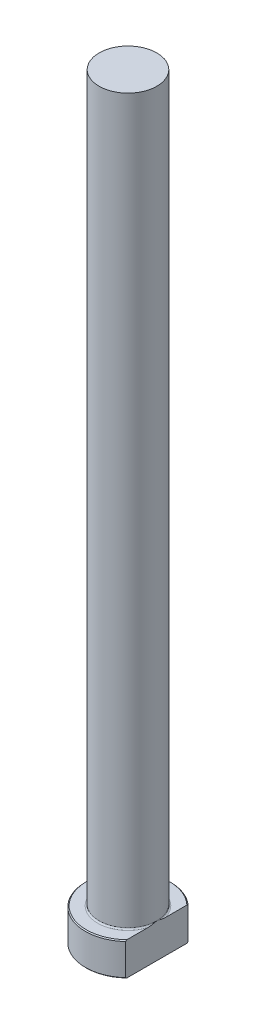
ISO-10303-21;
HEADER;
FILE_DESCRIPTION(('STEP AP214'),'2;1');
FILE_NAME('part.step','',(''),(''),'','','');
FILE_SCHEMA(('AUTOMOTIVE_DESIGN { 1 0 10303 214 1 1 1 1 }'));
ENDSEC;
DATA;
#1=APPLICATION_CONTEXT('core data for automotive mechanical design processes');
#2=APPLICATION_PROTOCOL_DEFINITION('international standard','automotive_design',2000,#1);
#3=PRODUCT_CONTEXT('',#1,'mechanical');
#4=PRODUCT('Part','Part','',(#3));
#5=PRODUCT_RELATED_PRODUCT_CATEGORY('part','',(#4));
#6=PRODUCT_DEFINITION_FORMATION('','',#4);
#7=PRODUCT_DEFINITION_CONTEXT('part definition',#1,'design');
#8=PRODUCT_DEFINITION('design','',#6,#7);
#9=PRODUCT_DEFINITION_SHAPE('','',#8);
#10=(LENGTH_UNIT() NAMED_UNIT(*) SI_UNIT(.MILLI.,.METRE.));
#11=(NAMED_UNIT(*) PLANE_ANGLE_UNIT() SI_UNIT($,.RADIAN.));
#12=(NAMED_UNIT(*) SI_UNIT($,.STERADIAN.) SOLID_ANGLE_UNIT());
#13=UNCERTAINTY_MEASURE_WITH_UNIT(LENGTH_MEASURE(1.E-05),#10,'distance_accuracy_value','');
#14=(GEOMETRIC_REPRESENTATION_CONTEXT(3) GLOBAL_UNCERTAINTY_ASSIGNED_CONTEXT((#13)) GLOBAL_UNIT_ASSIGNED_CONTEXT((#10,
#11,#12)) REPRESENTATION_CONTEXT('',''));
#15=CARTESIAN_POINT('',(0.,0.,0.));
#16=DIRECTION('',(0.,0.,1.));
#17=DIRECTION('',(1.,0.,0.));
#18=AXIS2_PLACEMENT_3D('',#15,#16,#17);
#19=CARTESIAN_POINT('',(0.,0.,0.));
#20=DIRECTION('',(0.,-1.,0.));
#21=DIRECTION('',(0.,0.,-1.));
#22=AXIS2_PLACEMENT_3D('',#19,#20,#21);
#23=PLANE('',#22);
#24=CARTESIAN_POINT('',(0.,0.,0.));
#25=DIRECTION('',(0.,-1.,0.));
#26=DIRECTION('',(0.,0.,-1.));
#27=AXIS2_PLACEMENT_3D('',#24,#25,#26);
#28=CIRCLE('',#27,8.79999999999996);
#29=CARTESIAN_POINT('',(6.09999999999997,0.,6.34271235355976));
#30=VERTEX_POINT('',#29);
#31=CARTESIAN_POINT('',(6.09999999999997,0.,-6.34271235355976));
#32=VERTEX_POINT('',#31);
#33=EDGE_CURVE('E98',#30,#32,#28,.T.);
#34=ORIENTED_EDGE('',*,*,#33,.T.);
#35=DIRECTION('',(0.,0.,1.));
#36=VECTOR('',#35,1.);
#37=CARTESIAN_POINT('',(6.09999999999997,0.,-6.61740130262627));
#38=LINE('',#37,#36);
#39=EDGE_CURVE('E83',#32,#30,#38,.T.);
#40=ORIENTED_EDGE('',*,*,#39,.T.);
#41=EDGE_LOOP('',(#34,#40));
#42=FACE_BOUND('',#41,.T.);
#43=ADVANCED_FACE('F32',(#42),#23,.T.);
#44=CARTESIAN_POINT('',(0.,259.958771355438,0.));
#45=DIRECTION('',(0.,1.,0.));
#46=DIRECTION('',(0.,0.,1.));
#47=AXIS2_PLACEMENT_3D('',#44,#45,#46);
#48=CYLINDRICAL_SURFACE('',#47,8.99999999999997);
#49=CARTESIAN_POINT('',(0.,6.80000000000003,0.));
#50=DIRECTION('',(0.,1.,0.));
#51=DIRECTION('',(0.,0.,1.));
#52=AXIS2_PLACEMENT_3D('',#49,#50,#51);
#53=CIRCLE('',#52,8.99999999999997);
#54=CARTESIAN_POINT('',(6.09999999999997,6.80000000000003,6.61740130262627));
#55=VERTEX_POINT('',#54);
#56=CARTESIAN_POINT('',(6.09999999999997,6.80000000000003,-6.61740130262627));
#57=VERTEX_POINT('',#56);
#58=EDGE_CURVE('E104',#55,#57,#53,.F.);
#59=ORIENTED_EDGE('',*,*,#58,.T.);
#60=DIRECTION('',(0.,-1.,0.));
#61=VECTOR('',#60,1.);
#62=CARTESIAN_POINT('',(6.09999999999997,160.,-6.61740130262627));
#63=LINE('',#62,#61);
#64=CARTESIAN_POINT('',(6.09999999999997,0.199999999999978,-6.61740130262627));
#65=VERTEX_POINT('',#64);
#66=EDGE_CURVE('E183',#57,#65,#63,.T.);
#67=ORIENTED_EDGE('',*,*,#66,.T.);
#68=CARTESIAN_POINT('',(0.,0.199999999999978,0.));
#69=DIRECTION('',(0.,-1.,0.));
#70=DIRECTION('',(0.,0.,-1.));
#71=AXIS2_PLACEMENT_3D('',#68,#69,#70);
#72=CIRCLE('',#71,8.99999999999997);
#73=CARTESIAN_POINT('',(6.09999999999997,0.199999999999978,6.61740130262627));
#74=VERTEX_POINT('',#73);
#75=EDGE_CURVE('E100',#65,#74,#72,.F.);
#76=ORIENTED_EDGE('',*,*,#75,.T.);
#77=DIRECTION('',(0.,-1.,0.));
#78=VECTOR('',#77,1.);
#79=CARTESIAN_POINT('',(6.09999999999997,160.,6.61740130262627));
#80=LINE('',#79,#78);
#81=EDGE_CURVE('E93',#55,#74,#80,.T.);
#82=ORIENTED_EDGE('',*,*,#81,.F.);
#83=EDGE_LOOP('',(#59,#67,#76,#82));
#84=FACE_BOUND('',#83,.T.);
#85=ADVANCED_FACE('F158',(#84),#48,.T.);
#86=CARTESIAN_POINT('',(-8.99999999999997,7.,0.));
#87=DIRECTION('',(0.,1.,0.));
#88=DIRECTION('',(0.,0.,1.));
#89=AXIS2_PLACEMENT_3D('',#86,#87,#88);
#90=PLANE('',#89);
#91=CARTESIAN_POINT('',(0.,7.,0.));
#92=DIRECTION('',(0.,1.,0.));
#93=DIRECTION('',(0.,0.,1.));
#94=AXIS2_PLACEMENT_3D('',#91,#92,#93);
#95=CIRCLE('',#94,8.79999999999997);
#96=CARTESIAN_POINT('',(6.09999999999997,7.,-6.34271235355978));
#97=VERTEX_POINT('',#96);
#98=CARTESIAN_POINT('',(6.09999999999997,7.,6.34271235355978));
#99=VERTEX_POINT('',#98);
#100=EDGE_CURVE('E178',#97,#99,#95,.T.);
#101=ORIENTED_EDGE('',*,*,#100,.T.);
#102=DIRECTION('',(0.,0.,-1.));
#103=VECTOR('',#102,1.);
#104=CARTESIAN_POINT('',(6.09999999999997,7.,0.));
#105=LINE('',#104,#103);
#106=CARTESIAN_POINT('',(6.09999999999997,6.99999999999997,1.9364916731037));
#107=VERTEX_POINT('',#106);
#108=EDGE_CURVE('E57',#99,#107,#105,.T.);
#109=ORIENTED_EDGE('',*,*,#108,.T.);
#110=CARTESIAN_POINT('',(0.,7.,0.));
#111=DIRECTION('',(0.,1.,0.));
#112=DIRECTION('',(0.,0.,1.));
#113=AXIS2_PLACEMENT_3D('',#110,#111,#112);
#114=CIRCLE('',#113,6.39999999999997);
#115=CARTESIAN_POINT('',(6.09999999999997,6.99999999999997,-1.9364916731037));
#116=VERTEX_POINT('',#115);
#117=EDGE_CURVE('E107',#107,#116,#114,.F.);
#118=ORIENTED_EDGE('',*,*,#117,.T.);
#119=EDGE_CURVE('E136',#116,#97,#105,.T.);
#120=ORIENTED_EDGE('',*,*,#119,.T.);
#121=EDGE_LOOP('',(#101,#109,#118,#120));
#122=FACE_BOUND('',#121,.T.);
#123=ADVANCED_FACE('F147',(#122),#90,.T.);
#124=CARTESIAN_POINT('',(0.,7.00000000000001,0.));
#125=DIRECTION('',(0.,-1.,0.));
#126=DIRECTION('',(0.,0.,-1.));
#127=AXIS2_PLACEMENT_3D('',#124,#125,#126);
#128=CONICAL_SURFACE('',#127,8.79999999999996,0.785398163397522);
#129=ORIENTED_EDGE('',*,*,#58,.F.);
#130=CARTESIAN_POINT('',(6.09999999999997,0.0143792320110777,14.5593895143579));
#131=CARTESIAN_POINT('',(6.09999999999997,0.214324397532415,14.3426005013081));
#132=CARTESIAN_POINT('',(6.09999999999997,0.413913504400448,14.1254831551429));
#133=CARTESIAN_POINT('',(6.09999999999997,0.812271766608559,13.6904946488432));
#134=CARTESIAN_POINT('',(6.09999999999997,1.01104091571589,13.4726234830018));
#135=CARTESIAN_POINT('',(6.09999999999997,1.6060389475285,12.8176429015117));
#136=CARTESIAN_POINT('',(6.09999999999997,2.00087078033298,12.3792612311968));
#137=CARTESIAN_POINT('',(6.09999999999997,2.78792222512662,11.4954287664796));
#138=CARTESIAN_POINT('',(6.09999999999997,3.18011200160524,11.0499513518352));
#139=CARTESIAN_POINT('',(6.09999999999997,3.95753447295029,10.1530375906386));
#140=CARTESIAN_POINT('',(6.09999999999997,4.34276798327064,9.70160195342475));
#141=CARTESIAN_POINT('',(6.09999999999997,5.03085646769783,8.87725822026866));
#142=CARTESIAN_POINT('',(6.09999999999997,5.33541849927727,8.50578180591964));
#143=CARTESIAN_POINT('',(6.09999999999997,5.78551221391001,7.94308202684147));
#144=CARTESIAN_POINT('',(6.09999999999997,5.93443884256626,7.75457459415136));
#145=CARTESIAN_POINT('',(6.09999999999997,6.22957503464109,7.37544710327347));
#146=CARTESIAN_POINT('',(6.09999999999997,6.3757846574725,7.18482709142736));
#147=CARTESIAN_POINT('',(6.09999999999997,6.66478900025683,6.80131984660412));
#148=CARTESIAN_POINT('',(6.09999999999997,6.80758709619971,6.60843516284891));
#149=CARTESIAN_POINT('',(6.09999999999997,7.08920912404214,6.21979246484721));
#150=CARTESIAN_POINT('',(6.09999999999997,7.22803324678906,6.02403458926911));
#151=CARTESIAN_POINT('',(6.09999999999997,7.50074563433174,5.62920968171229));
#152=CARTESIAN_POINT('',(6.09999999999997,7.63463576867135,5.43014394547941));
#153=CARTESIAN_POINT('',(6.09999999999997,7.89632379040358,5.02806147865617));
#154=CARTESIAN_POINT('',(6.09999999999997,8.02412236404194,4.82504519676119));
#155=CARTESIAN_POINT('',(6.09999999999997,8.27075787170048,4.41652900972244));
#156=CARTESIAN_POINT('',(6.09999999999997,8.38967506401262,4.21107783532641));
#157=CARTESIAN_POINT('',(6.09999999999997,8.61801299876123,3.7948929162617));
#158=CARTESIAN_POINT('',(6.09999999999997,8.72743269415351,3.58415859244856));
#159=CARTESIAN_POINT('',(6.09999999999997,8.93404173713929,3.15694629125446));
#160=CARTESIAN_POINT('',(6.09999999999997,9.0312415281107,2.94047341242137));
#161=CARTESIAN_POINT('',(6.09999999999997,9.21017577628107,2.50119284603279));
#162=CARTESIAN_POINT('',(6.09999999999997,9.29191471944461,2.27838701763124));
#163=CARTESIAN_POINT('',(6.09999999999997,9.42038701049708,1.87551854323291));
#164=CARTESIAN_POINT('',(6.09999999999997,9.47086768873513,1.69665770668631));
#165=CARTESIAN_POINT('',(6.09999999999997,9.55795989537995,1.33556522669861));
#166=CARTESIAN_POINT('',(6.09999999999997,9.59457323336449,1.15333402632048));
#167=CARTESIAN_POINT('',(6.09999999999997,9.65210004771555,0.786944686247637));
#168=CARTESIAN_POINT('',(6.09999999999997,9.67306111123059,0.602794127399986));
#169=CARTESIAN_POINT('',(6.09999999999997,9.69831980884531,0.23334258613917));
#170=CARTESIAN_POINT('',(6.09999999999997,9.70261818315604,0.0480416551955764));
#171=CARTESIAN_POINT('',(6.09999999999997,9.69429534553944,-0.322485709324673));
#172=CARTESIAN_POINT('',(6.09999999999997,9.68164564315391,-0.507711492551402));
#173=CARTESIAN_POINT('',(6.09999999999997,9.64009976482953,-0.876317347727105));
#174=CARTESIAN_POINT('',(6.09999999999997,9.61120224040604,-1.0596972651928));
#175=CARTESIAN_POINT('',(6.09999999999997,9.53854055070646,-1.42403078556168));
#176=CARTESIAN_POINT('',(6.09999999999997,9.49473105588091,-1.60497522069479));
#177=CARTESIAN_POINT('',(6.09999999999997,9.39417906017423,-1.96319042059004));
#178=CARTESIAN_POINT('',(6.09999999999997,9.33743624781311,-2.14046109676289));
#179=CARTESIAN_POINT('',(6.09999999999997,9.20325707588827,-2.51852539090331));
#180=CARTESIAN_POINT('',(6.09999999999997,9.12397188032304,-2.71865799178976));
#181=CARTESIAN_POINT('',(6.09999999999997,8.95352574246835,-3.11384323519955));
#182=CARTESIAN_POINT('',(6.09999999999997,8.86235948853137,-3.30889355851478));
#183=CARTESIAN_POINT('',(6.09999999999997,8.67035859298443,-3.69456420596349));
#184=CARTESIAN_POINT('',(6.09999999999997,8.56950736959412,-3.88517621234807));
#185=CARTESIAN_POINT('',(6.09999999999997,8.36017703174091,-4.26210307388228));
#186=CARTESIAN_POINT('',(6.09999999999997,8.25169895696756,-4.44841851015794));
#187=CARTESIAN_POINT('',(6.09999999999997,8.02723055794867,-4.81954803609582));
#188=CARTESIAN_POINT('',(6.09999999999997,7.91116499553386,-5.00431640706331));
#189=CARTESIAN_POINT('',(6.09999999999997,7.67391977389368,-5.37053346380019));
#190=CARTESIAN_POINT('',(6.09999999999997,7.55273998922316,-5.55198206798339));
#191=CARTESIAN_POINT('',(6.09999999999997,7.30632827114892,-5.91182164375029));
#192=CARTESIAN_POINT('',(6.09999999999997,7.18110067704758,-6.09021559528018));
#193=CARTESIAN_POINT('',(6.09999999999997,6.92719024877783,-6.44453156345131));
#194=CARTESIAN_POINT('',(6.09999999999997,6.79850727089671,-6.62045347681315));
#195=CARTESIAN_POINT('',(6.09999999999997,6.40743139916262,-7.14601004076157));
#196=CARTESIAN_POINT('',(6.09999999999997,6.14071269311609,-7.49242581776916));
#197=CARTESIAN_POINT('',(6.09999999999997,5.59909026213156,-8.17880344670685));
#198=CARTESIAN_POINT('',(6.09999999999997,5.32418574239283,-8.51876466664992));
#199=CARTESIAN_POINT('',(6.09999999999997,4.76812622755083,-9.19396082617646));
#200=CARTESIAN_POINT('',(6.09999999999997,4.48696661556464,-9.52919195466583));
#201=CARTESIAN_POINT('',(6.09999999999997,3.92006700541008,-10.1957589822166));
#202=CARTESIAN_POINT('',(6.09999999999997,3.63432692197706,-10.5270948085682));
#203=CARTESIAN_POINT('',(6.09999999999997,3.07379660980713,-11.1700382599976));
#204=CARTESIAN_POINT('',(6.09999999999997,2.79918078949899,-11.4817981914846));
#205=CARTESIAN_POINT('',(6.09999999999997,2.24738477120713,-12.1030461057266));
#206=CARTESIAN_POINT('',(6.09999999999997,1.97020453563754,-12.4125340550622));
#207=CARTESIAN_POINT('',(6.09999999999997,1.41421579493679,-13.0291430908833));
#208=CARTESIAN_POINT('',(6.09999999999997,1.13541061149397,-13.3362671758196));
#209=CARTESIAN_POINT('',(6.09999999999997,0.576091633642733,-13.9489357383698));
#210=CARTESIAN_POINT('',(6.09999999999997,0.295577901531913,-14.2544802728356));
#211=CARTESIAN_POINT('',(6.09999999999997,0.0143792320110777,-14.5593895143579));
#212=B_SPLINE_CURVE_WITH_KNOTS('',3,(#130,#131,#132,#133,#134,#135,#136,#137,#138,#139,#140,
#141,#142,#143,#144,#145,#146,#147,#148,#149,#150,#151,#152,#153,#154,#155,#156,#157,#158,#159,
#160,#161,#162,#163,#164,#165,#166,#167,#168,#169,#170,#171,#172,#173,#174,#175,#176,#177,#178,
#179,#180,#181,#182,#183,#184,#185,#186,#187,#188,#189,#190,#191,#192,#193,#194,#195,#196,#197,
#198,#199,#200,#201,#202,#203,#204,#205,#206,#207,#208,#209,#210,#211),.UNSPECIFIED.,.F.,.F.,(4,
2,2,2,2,2,2,2,2,2,2,2,2,2,2,2,2,2,2,2,2,2,2,2,2,2,2,2,2,2,2,2,2,2,2,2,2,2,2,2,4),(0.,
0.88474771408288,1.76950214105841,3.53939834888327,5.31990146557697,7.10019448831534,
8.54118050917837,9.26187437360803,9.98255246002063,10.7024850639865,11.4223830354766,
12.1420053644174,12.8615464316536,13.5735035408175,14.2855390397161,14.9969618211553,
15.7081778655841,16.2652530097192,16.822255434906,17.3775574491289,17.9328347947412,
18.4890467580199,19.0453048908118,19.6032692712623,20.1612470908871,20.8065589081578,
21.4521602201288,22.0988872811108,22.7455263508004,23.4000191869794,24.0545280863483,
24.7083572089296,25.3622135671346,26.6736120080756,27.9851381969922,29.2976668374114,
30.6102199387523,31.8565868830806,33.102972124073,34.3473597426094,35.5917022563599),.UNSPECIFIED.);
#213=EDGE_CURVE('E135',#55,#99,#212,.T.);
#214=ORIENTED_EDGE('',*,*,#213,.T.);
#215=ORIENTED_EDGE('',*,*,#100,.F.);
#216=EDGE_CURVE('E127',#97,#57,#212,.T.);
#217=ORIENTED_EDGE('',*,*,#216,.T.);
#218=EDGE_LOOP('',(#129,#214,#215,#217));
#219=FACE_BOUND('',#218,.T.);
#220=ADVANCED_FACE('F143',(#219),#128,.T.);
#221=CARTESIAN_POINT('',(0.,0.199999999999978,0.));
#222=DIRECTION('',(0.,1.,0.));
#223=DIRECTION('',(0.,0.,1.));
#224=AXIS2_PLACEMENT_3D('',#221,#222,#223);
#225=CONICAL_SURFACE('',#224,8.99999999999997,0.785398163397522);
#226=ORIENTED_EDGE('',*,*,#75,.F.);
#227=CARTESIAN_POINT('',(6.09999999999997,6.98562076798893,-14.5593895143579));
#228=CARTESIAN_POINT('',(6.09999999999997,6.78567560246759,-14.3426005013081));
#229=CARTESIAN_POINT('',(6.09999999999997,6.58608649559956,-14.1254831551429));
#230=CARTESIAN_POINT('',(6.09999999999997,6.18772823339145,-13.6904946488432));
#231=CARTESIAN_POINT('',(6.09999999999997,5.98895908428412,-13.4726234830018));
#232=CARTESIAN_POINT('',(6.09999999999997,5.39396105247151,-12.8176429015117));
#233=CARTESIAN_POINT('',(6.09999999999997,4.99912921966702,-12.3792612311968));
#234=CARTESIAN_POINT('',(6.09999999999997,4.21207777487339,-11.4954287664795));
#235=CARTESIAN_POINT('',(6.09999999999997,3.81988799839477,-11.0499513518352));
#236=CARTESIAN_POINT('',(6.09999999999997,3.04246552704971,-10.1530375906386));
#237=CARTESIAN_POINT('',(6.09999999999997,2.65723201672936,-9.70160195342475));
#238=CARTESIAN_POINT('',(6.09999999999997,1.96914353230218,-8.87725822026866));
#239=CARTESIAN_POINT('',(6.09999999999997,1.66458150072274,-8.50578180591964));
#240=CARTESIAN_POINT('',(6.09999999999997,1.21448778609,-7.94308202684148));
#241=CARTESIAN_POINT('',(6.09999999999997,1.06556115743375,-7.75457459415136));
#242=CARTESIAN_POINT('',(6.09999999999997,0.770424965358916,-7.37544710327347));
#243=CARTESIAN_POINT('',(6.09999999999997,0.624215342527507,-7.18482709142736));
#244=CARTESIAN_POINT('',(6.09999999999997,0.335210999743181,-6.80131984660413));
#245=CARTESIAN_POINT('',(6.09999999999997,0.192412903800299,-6.60843516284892));
#246=CARTESIAN_POINT('',(6.09999999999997,-0.0892091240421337,-6.21979246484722));
#247=CARTESIAN_POINT('',(6.09999999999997,-0.228033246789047,-6.02403458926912));
#248=CARTESIAN_POINT('',(6.09999999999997,-0.500745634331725,-5.6292096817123));
#249=CARTESIAN_POINT('',(6.09999999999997,-0.634635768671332,-5.43014394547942));
#250=CARTESIAN_POINT('',(6.09999999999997,-0.896323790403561,-5.02806147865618));
#251=CARTESIAN_POINT('',(6.09999999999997,-1.02412236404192,-4.8250451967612));
#252=CARTESIAN_POINT('',(6.09999999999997,-1.27075787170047,-4.41652900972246));
#253=CARTESIAN_POINT('',(6.09999999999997,-1.3896750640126,-4.21107783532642));
#254=CARTESIAN_POINT('',(6.09999999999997,-1.61801299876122,-3.79489291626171));
#255=CARTESIAN_POINT('',(6.09999999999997,-1.7274326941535,-3.58415859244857));
#256=CARTESIAN_POINT('',(6.09999999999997,-1.93404173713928,-3.15694629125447));
#257=CARTESIAN_POINT('',(6.09999999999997,-2.03124152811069,-2.94047341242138));
#258=CARTESIAN_POINT('',(6.09999999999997,-2.21017577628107,-2.50119284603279));
#259=CARTESIAN_POINT('',(6.09999999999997,-2.2919147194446,-2.27838701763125));
#260=CARTESIAN_POINT('',(6.09999999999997,-2.42038701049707,-1.87551854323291));
#261=CARTESIAN_POINT('',(6.09999999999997,-2.47086768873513,-1.69665770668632));
#262=CARTESIAN_POINT('',(6.09999999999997,-2.55795989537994,-1.33556522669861));
#263=CARTESIAN_POINT('',(6.09999999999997,-2.59457323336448,-1.15333402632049));
#264=CARTESIAN_POINT('',(6.09999999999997,-2.65210004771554,-0.786944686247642));
#265=CARTESIAN_POINT('',(6.09999999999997,-2.67306111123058,-0.60279412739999));
#266=CARTESIAN_POINT('',(6.09999999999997,-2.69831980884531,-0.233342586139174));
#267=CARTESIAN_POINT('',(6.09999999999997,-2.70261818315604,-0.0480416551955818));
#268=CARTESIAN_POINT('',(6.09999999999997,-2.69429534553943,0.322485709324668));
#269=CARTESIAN_POINT('',(6.09999999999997,-2.6816456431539,0.507711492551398));
#270=CARTESIAN_POINT('',(6.09999999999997,-2.64009976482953,0.876317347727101));
#271=CARTESIAN_POINT('',(6.09999999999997,-2.61120224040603,1.05969726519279));
#272=CARTESIAN_POINT('',(6.09999999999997,-2.53854055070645,1.42403078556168));
#273=CARTESIAN_POINT('',(6.09999999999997,-2.4947310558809,1.60497522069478));
#274=CARTESIAN_POINT('',(6.09999999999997,-2.39417906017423,1.96319042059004));
#275=CARTESIAN_POINT('',(6.09999999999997,-2.33743624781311,2.14046109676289));
#276=CARTESIAN_POINT('',(6.09999999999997,-2.20325707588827,2.51852539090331));
#277=CARTESIAN_POINT('',(6.09999999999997,-2.12397188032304,2.71865799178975));
#278=CARTESIAN_POINT('',(6.09999999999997,-1.95352574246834,3.11384323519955));
#279=CARTESIAN_POINT('',(6.09999999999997,-1.86235948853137,3.30889355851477));
#280=CARTESIAN_POINT('',(6.09999999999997,-1.67035859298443,3.69456420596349));
#281=CARTESIAN_POINT('',(6.09999999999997,-1.56950736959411,3.88517621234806));
#282=CARTESIAN_POINT('',(6.09999999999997,-1.36017703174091,4.26210307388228));
#283=CARTESIAN_POINT('',(6.09999999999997,-1.25169895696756,4.44841851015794));
#284=CARTESIAN_POINT('',(6.09999999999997,-1.02723055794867,4.81954803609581));
#285=CARTESIAN_POINT('',(6.09999999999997,-0.911164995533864,5.0043164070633));
#286=CARTESIAN_POINT('',(6.09999999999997,-0.673919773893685,5.37053346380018));
#287=CARTESIAN_POINT('',(6.09999999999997,-0.552739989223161,5.55198206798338));
#288=CARTESIAN_POINT('',(6.09999999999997,-0.306328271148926,5.91182164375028));
#289=CARTESIAN_POINT('',(6.09999999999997,-0.181100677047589,6.09021559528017));
#290=CARTESIAN_POINT('',(6.09999999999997,0.0728097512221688,6.44453156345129));
#291=CARTESIAN_POINT('',(6.09999999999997,0.201492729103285,6.62045347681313));
#292=CARTESIAN_POINT('',(6.09999999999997,0.592568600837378,7.14601004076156));
#293=CARTESIAN_POINT('',(6.09999999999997,0.859287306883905,7.49242581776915));
#294=CARTESIAN_POINT('',(6.09999999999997,1.40090973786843,8.17880344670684));
#295=CARTESIAN_POINT('',(6.09999999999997,1.67581425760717,8.51876466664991));
#296=CARTESIAN_POINT('',(6.09999999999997,2.23187377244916,9.19396082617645));
#297=CARTESIAN_POINT('',(6.09999999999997,2.51303338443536,9.52919195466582));
#298=CARTESIAN_POINT('',(6.09999999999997,3.07993299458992,10.1957589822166));
#299=CARTESIAN_POINT('',(6.09999999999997,3.36567307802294,10.5270948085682));
#300=CARTESIAN_POINT('',(6.09999999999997,3.92620339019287,11.1700382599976));
#301=CARTESIAN_POINT('',(6.09999999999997,4.20081921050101,11.4817981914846));
#302=CARTESIAN_POINT('',(6.09999999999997,4.75261522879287,12.1030461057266));
#303=CARTESIAN_POINT('',(6.09999999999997,5.02979546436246,12.4125340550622));
#304=CARTESIAN_POINT('',(6.09999999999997,5.58578420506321,13.0291430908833));
#305=CARTESIAN_POINT('',(6.09999999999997,5.86458938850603,13.3362671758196));
#306=CARTESIAN_POINT('',(6.09999999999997,6.42390836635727,13.9489357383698));
#307=CARTESIAN_POINT('',(6.09999999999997,6.70442209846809,14.2544802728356));
#308=CARTESIAN_POINT('',(6.09999999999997,6.98562076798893,14.5593895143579));
#309=B_SPLINE_CURVE_WITH_KNOTS('',3,(#227,#228,#229,#230,#231,#232,#233,#234,#235,#236,#237,
#238,#239,#240,#241,#242,#243,#244,#245,#246,#247,#248,#249,#250,#251,#252,#253,#254,#255,#256,
#257,#258,#259,#260,#261,#262,#263,#264,#265,#266,#267,#268,#269,#270,#271,#272,#273,#274,#275,
#276,#277,#278,#279,#280,#281,#282,#283,#284,#285,#286,#287,#288,#289,#290,#291,#292,#293,#294,
#295,#296,#297,#298,#299,#300,#301,#302,#303,#304,#305,#306,#307,#308),.UNSPECIFIED.,.F.,.F.,(4,
2,2,2,2,2,2,2,2,2,2,2,2,2,2,2,2,2,2,2,2,2,2,2,2,2,2,2,2,2,2,2,2,2,2,2,2,2,2,2,4),(0.,
0.884747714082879,1.76950214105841,3.53939834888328,5.31990146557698,7.10019448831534,
8.54118050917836,9.26187437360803,9.98255246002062,10.7024850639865,11.4223830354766,
12.1420053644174,12.8615464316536,13.5735035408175,14.2855390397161,14.9969618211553,
15.7081778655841,16.2652530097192,16.822255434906,17.3775574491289,17.9328347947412,
18.4890467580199,19.0453048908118,19.6032692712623,20.1612470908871,20.8065589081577,
21.4521602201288,22.0988872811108,22.7455263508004,23.4000191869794,24.0545280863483,
24.7083572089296,25.3622135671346,26.6736120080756,27.9851381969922,29.2976668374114,
30.6102199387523,31.8565868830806,33.102972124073,34.3473597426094,35.5917022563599),.UNSPECIFIED.);
#310=EDGE_CURVE('E86',#65,#32,#309,.T.);
#311=ORIENTED_EDGE('',*,*,#310,.T.);
#312=ORIENTED_EDGE('',*,*,#33,.F.);
#313=EDGE_CURVE('E89',#30,#74,#309,.T.);
#314=ORIENTED_EDGE('',*,*,#313,.T.);
#315=EDGE_LOOP('',(#226,#311,#312,#314));
#316=FACE_BOUND('',#315,.T.);
#317=ADVANCED_FACE('F97',(#316),#225,.T.);
#318=CARTESIAN_POINT('',(0.,7.29999999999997,0.));
#319=DIRECTION('',(0.,1.,0.));
#320=DIRECTION('',(0.,0.,1.));
#321=AXIS2_PLACEMENT_3D('',#318,#319,#320);
#322=TOROIDAL_SURFACE('',#321,6.39999999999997,0.3);
#323=CARTESIAN_POINT('',(6.09999999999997,7.29999999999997,0.));
#324=CARTESIAN_POINT('',(6.09999999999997,7.30000062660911,-8.49340882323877E-11));
#325=CARTESIAN_POINT('',(6.09999999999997,7.30000125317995,-2.89750604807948E-07));
#326=CARTESIAN_POINT('',(6.09999999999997,7.30000241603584,-1.06233729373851E-06));
#327=CARTESIAN_POINT('',(6.09999999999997,7.30000292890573,-1.56598288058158E-06));
#328=CARTESIAN_POINT('',(6.09999999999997,7.30000401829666,-2.78036834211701E-06));
#329=CARTESIAN_POINT('',(6.09999999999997,7.30000457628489,-3.51079357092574E-06));
#330=CARTESIAN_POINT('',(6.09999999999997,7.30000555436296,-5.00545869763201E-06));
#331=CARTESIAN_POINT('',(6.09999999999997,7.30000597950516,-5.76672403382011E-06));
#332=CARTESIAN_POINT('',(6.09999999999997,7.30000761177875,-8.78783125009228E-06));
#333=CARTESIAN_POINT('',(6.09999999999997,7.30000873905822,-1.10951031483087E-05));
#334=CARTESIAN_POINT('',(6.09999999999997,7.30001054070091,-1.56065756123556E-05));
#335=CARTESIAN_POINT('',(6.09999999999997,7.30001124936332,-1.77975625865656E-05));
#336=CARTESIAN_POINT('',(6.09999999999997,7.3000143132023,-2.72682416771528E-05));
#337=CARTESIAN_POINT('',(6.09999999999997,7.30001667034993,-3.45497120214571E-05));
#338=CARTESIAN_POINT('',(6.09999999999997,7.30002005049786,-4.8163199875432E-05));
#339=CARTESIAN_POINT('',(6.09999999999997,7.30002122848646,-5.44561398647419E-05));
#340=CARTESIAN_POINT('',(6.09999999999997,7.30002994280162,-0.000101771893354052));
#341=CARTESIAN_POINT('',(6.09999999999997,7.30003670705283,-0.000142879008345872));
#342=CARTESIAN_POINT('',(6.09999999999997,7.30006629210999,-0.000306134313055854));
#343=CARTESIAN_POINT('',(6.09999999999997,7.30009435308,-0.000427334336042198));
#344=CARTESIAN_POINT('',(6.09999999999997,7.30020422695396,-0.000909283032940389));
#345=CARTESIAN_POINT('',(6.09999999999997,7.30028277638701,-0.00127051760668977));
#346=CARTESIAN_POINT('',(6.09999999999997,7.30059854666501,-0.00271271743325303));
#347=CARTESIAN_POINT('',(6.09999999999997,7.30083994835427,-0.00379303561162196));
#348=CARTESIAN_POINT('',(6.09999999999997,7.30185162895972,-0.00833170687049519));
#349=CARTESIAN_POINT('',(6.09999999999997,7.30261657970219,-0.0117908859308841));
#350=CARTESIAN_POINT('',(6.09999999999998,7.30941584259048,-0.0425231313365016));
#351=CARTESIAN_POINT('',(6.09999999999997,7.31547175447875,-0.0697929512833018));
#352=CARTESIAN_POINT('',(6.09999999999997,7.32730575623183,-0.123231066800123));
#353=CARTESIAN_POINT('',(6.09999999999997,7.33308513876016,-0.149399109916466));
#354=CARTESIAN_POINT('',(6.09999999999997,7.34535810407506,-0.205120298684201));
#355=CARTESIAN_POINT('',(6.09999999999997,7.35184757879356,-0.234674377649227));
#356=CARTESIAN_POINT('',(6.09999999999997,7.36483397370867,-0.294125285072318));
#357=CARTESIAN_POINT('',(6.09999999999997,7.37133017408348,-0.324022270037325));
#358=CARTESIAN_POINT('',(6.09999999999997,7.3868079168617,-0.39575720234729));
#359=CARTESIAN_POINT('',(6.09999999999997,7.39574786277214,-0.437604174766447));
#360=CARTESIAN_POINT('',(6.09999999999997,7.41315372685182,-0.520210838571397));
#361=CARTESIAN_POINT('',(6.09999999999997,7.42162592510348,-0.560969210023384));
#362=CARTESIAN_POINT('',(6.09999999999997,7.44897438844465,-0.694856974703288));
#363=CARTESIAN_POINT('',(6.09999999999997,7.46725806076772,-0.788109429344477));
#364=CARTESIAN_POINT('',(6.09999999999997,7.50173201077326,-0.975940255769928));
#365=CARTESIAN_POINT('',(6.09999999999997,7.51790033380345,-1.07052272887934));
#366=CARTESIAN_POINT('',(6.09999999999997,7.5483609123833,-1.26941791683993));
#367=CARTESIAN_POINT('',(6.09999999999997,7.56231819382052,-1.37378304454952));
#368=CARTESIAN_POINT('',(6.09999999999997,7.58455179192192,-1.58284720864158));
#369=CARTESIAN_POINT('',(6.09999999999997,7.59284552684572,-1.68754421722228));
#370=CARTESIAN_POINT('',(6.09999999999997,7.59905685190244,-1.84322200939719));
#371=CARTESIAN_POINT('',(6.09999999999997,7.60011923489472,-1.89407517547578));
#372=CARTESIAN_POINT('',(6.09999999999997,7.59985882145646,-1.99583446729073));
#373=CARTESIAN_POINT('',(6.09999999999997,7.59853367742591,-2.04674059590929));
#374=CARTESIAN_POINT('',(6.09999999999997,7.59293461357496,-2.14745109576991));
#375=CARTESIAN_POINT('',(6.09999999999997,7.58871621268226,-2.19725829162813));
#376=CARTESIAN_POINT('',(6.09999999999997,7.57652343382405,-2.29636696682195));
#377=CARTESIAN_POINT('',(6.09999999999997,7.56855424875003,-2.34566904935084));
#378=CARTESIAN_POINT('',(6.09999999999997,7.54906685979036,-2.43557410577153));
#379=CARTESIAN_POINT('',(6.09999999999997,7.53830158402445,-2.47632837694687));
#380=CARTESIAN_POINT('',(6.09999999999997,7.51813116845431,-2.53619759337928));
#381=CARTESIAN_POINT('',(6.09999999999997,7.51071988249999,-2.55597892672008));
#382=CARTESIAN_POINT('',(6.09999999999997,7.49420581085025,-2.59481280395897));
#383=CARTESIAN_POINT('',(6.09999999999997,7.48510530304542,-2.61386628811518));
#384=CARTESIAN_POINT('',(6.09999999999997,7.46462437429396,-2.65097502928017));
#385=CARTESIAN_POINT('',(6.09999999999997,7.4532219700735,-2.66901833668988));
#386=CARTESIAN_POINT('',(6.09999999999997,7.42747894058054,-2.70281743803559));
#387=CARTESIAN_POINT('',(6.09999999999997,7.41316603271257,-2.71859257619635));
#388=CARTESIAN_POINT('',(6.09999999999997,7.39059237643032,-2.73744251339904));
#389=CARTESIAN_POINT('',(6.09999999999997,7.38392912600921,-2.74241546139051));
#390=CARTESIAN_POINT('',(6.09999999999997,7.36998483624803,-2.75142973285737));
#391=CARTESIAN_POINT('',(6.09999999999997,7.36270362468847,-2.75547079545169));
#392=CARTESIAN_POINT('',(6.09999999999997,7.34749053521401,-2.76237207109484));
#393=CARTESIAN_POINT('',(6.09999999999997,7.33955232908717,-2.76521867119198));
#394=CARTESIAN_POINT('',(6.09999999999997,7.3232826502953,-2.76936266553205));
#395=CARTESIAN_POINT('',(6.09999999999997,7.3149518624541,-2.7706626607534));
#396=CARTESIAN_POINT('',(6.09999999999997,7.29896440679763,-2.77151083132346));
#397=CARTESIAN_POINT('',(6.09999999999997,7.29131555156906,-2.77120796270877));
#398=CARTESIAN_POINT('',(6.09999999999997,7.27619804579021,-2.76922646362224));
#399=CARTESIAN_POINT('',(6.09999999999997,7.26872952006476,-2.76754690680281));
#400=CARTESIAN_POINT('',(6.09999999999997,7.25296547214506,-2.76260061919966));
#401=CARTESIAN_POINT('',(6.09999999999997,7.24473928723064,-2.75911619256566));
#402=CARTESIAN_POINT('',(6.09999999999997,7.22896148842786,-2.75086515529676));
#403=CARTESIAN_POINT('',(6.09999999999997,7.22141106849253,-2.74609633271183));
#404=CARTESIAN_POINT('',(6.09999999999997,7.20301227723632,-2.73270182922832));
#405=CARTESIAN_POINT('',(6.09999999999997,7.1926580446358,-2.72340416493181));
#406=CARTESIAN_POINT('',(6.09999999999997,7.1734395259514,-2.70338710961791));
#407=CARTESIAN_POINT('',(6.09999999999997,7.1645795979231,-2.69266371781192));
#408=CARTESIAN_POINT('',(6.09999999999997,7.14025540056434,-2.65971164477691));
#409=CARTESIAN_POINT('',(6.09999999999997,7.12651072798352,-2.63622875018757));
#410=CARTESIAN_POINT('',(6.09999999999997,7.10227969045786,-2.58772082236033));
#411=CARTESIAN_POINT('',(6.09999999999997,7.09179747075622,-2.56269387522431));
#412=CARTESIAN_POINT('',(6.09999999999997,7.0688846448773,-2.49991766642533));
#413=CARTESIAN_POINT('',(6.09999999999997,7.05782215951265,-2.46167427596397));
#414=CARTESIAN_POINT('',(6.09999999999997,7.03925041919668,-2.38430824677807));
#415=CARTESIAN_POINT('',(6.09999999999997,7.03174899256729,-2.34518386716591));
#416=CARTESIAN_POINT('',(6.09999999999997,7.01934937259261,-2.26583226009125));
#417=CARTESIAN_POINT('',(6.09999999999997,7.01449904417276,-2.22559771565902));
#418=CARTESIAN_POINT('',(6.09999999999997,7.00701943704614,-2.14499086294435));
#419=CARTESIAN_POINT('',(6.09999999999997,7.00438710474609,-2.10461882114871));
#420=CARTESIAN_POINT('',(6.09999999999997,6.99952969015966,-1.99154987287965));
#421=CARTESIAN_POINT('',(6.09999999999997,6.99930606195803,-1.91876811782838));
#422=CARTESIAN_POINT('',(6.09999999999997,7.00309053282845,-1.77330138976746));
#423=CARTESIAN_POINT('',(6.09999999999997,7.00710151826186,-1.70061651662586));
#424=CARTESIAN_POINT('',(6.09999999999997,7.01839350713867,-1.55515240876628));
#425=CARTESIAN_POINT('',(6.09999999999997,7.02569039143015,-1.4823744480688));
#426=CARTESIAN_POINT('',(6.09999999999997,7.0428282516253,-1.33711517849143));
#427=CARTESIAN_POINT('',(6.09999999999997,7.05266964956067,-1.2646339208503));
#428=CARTESIAN_POINT('',(6.09999999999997,7.08305970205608,-1.06158751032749));
#429=CARTESIAN_POINT('',(6.09999999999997,7.1058392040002,-0.931360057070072));
#430=CARTESIAN_POINT('',(6.09999999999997,7.15498382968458,-0.6732160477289));
#431=CARTESIAN_POINT('',(6.09999999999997,7.18130321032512,-0.545290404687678));
#432=CARTESIAN_POINT('',(6.09999999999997,7.2144838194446,-0.38980494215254));
#433=CARTESIAN_POINT('',(6.09999999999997,7.22045276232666,-0.362051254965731));
#434=CARTESIAN_POINT('',(6.09999999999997,7.23263801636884,-0.305748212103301));
#435=CARTESIAN_POINT('',(6.09999999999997,7.2388564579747,-0.277199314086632));
#436=CARTESIAN_POINT('',(6.09999999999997,7.25406223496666,-0.207696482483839));
#437=CARTESIAN_POINT('',(6.09999999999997,7.26307730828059,-0.166748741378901));
#438=CARTESIAN_POINT('',(6.09999999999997,7.28028241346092,-0.0889531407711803));
#439=CARTESIAN_POINT('',(6.09999999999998,7.28846503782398,-0.052103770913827));
#440=CARTESIAN_POINT('',(6.09999999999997,7.29738224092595,-0.0117959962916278));
#441=CARTESIAN_POINT('',(6.09999999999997,7.2981461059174,-0.00834194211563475));
#442=CARTESIAN_POINT('',(6.09999999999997,7.29915753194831,-0.0038044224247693));
#443=CARTESIAN_POINT('',(6.09999999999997,7.29939981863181,-0.00272013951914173));
#444=CARTESIAN_POINT('',(6.09999999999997,7.29971666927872,-0.00127300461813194));
#445=CARTESIAN_POINT('',(6.09999999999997,7.29979542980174,-0.000910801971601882));
#446=CARTESIAN_POINT('',(6.09999999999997,7.29990555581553,-0.000427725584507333));
#447=CARTESIAN_POINT('',(6.09999999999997,7.29993365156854,-0.000306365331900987));
#448=CARTESIAN_POINT('',(6.09999999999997,7.29996326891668,-0.000142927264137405));
#449=CARTESIAN_POINT('',(6.09999999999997,7.29997003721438,-0.000101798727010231));
#450=CARTESIAN_POINT('',(6.09999999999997,7.29997875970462,-5.44609821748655E-05));
#451=CARTESIAN_POINT('',(6.09999999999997,7.29997993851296,-4.81669455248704E-05));
#452=CARTESIAN_POINT('',(6.09999999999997,7.29998332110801,-3.45511307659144E-05));
#453=CARTESIAN_POINT('',(6.09999999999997,7.29998568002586,-2.726848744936E-05));
#454=CARTESIAN_POINT('',(6.09999999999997,7.2999887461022,-1.77965710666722E-05));
#455=CARTESIAN_POINT('',(6.09999999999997,7.29998945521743,-1.5605504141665E-05));
#456=CARTESIAN_POINT('',(6.09999999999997,7.29999125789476,-1.10939383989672E-05));
#457=CARTESIAN_POINT('',(6.09999999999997,7.29999238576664,-8.78666464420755E-06));
#458=CARTESIAN_POINT('',(6.09999999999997,7.29999401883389,-5.76563104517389E-06));
#459=CARTESIAN_POINT('',(6.09999999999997,7.2999944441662,-5.00441018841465E-06));
#460=CARTESIAN_POINT('',(6.09999999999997,7.29999542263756,-3.50986831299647E-06));
#461=CARTESIAN_POINT('',(6.09999999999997,7.29999598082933,-2.77952359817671E-06));
#462=CARTESIAN_POINT('',(6.09999999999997,7.29999707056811,-1.56532290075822E-06));
#463=CARTESIAN_POINT('',(6.09999999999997,7.29999758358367,-1.06177376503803E-06));
#464=CARTESIAN_POINT('',(6.09999999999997,7.29999874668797,-2.89436475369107E-07));
#465=CARTESIAN_POINT('',(6.09999999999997,7.29999937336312,8.49378445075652E-11));
#466=CARTESIAN_POINT('',(6.09999999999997,7.29999999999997,0.));
#467=B_SPLINE_CURVE_WITH_KNOTS('',3,(#323,#324,#325,#326,#327,#328,#329,#330,#331,#332,#333,
#334,#335,#336,#337,#338,#339,#340,#341,#342,#343,#344,#345,#346,#347,#348,#349,#350,#351,#352,
#353,#354,#355,#356,#357,#358,#359,#360,#361,#362,#363,#364,#365,#366,#367,#368,#369,#370,#371,
#372,#373,#374,#375,#376,#377,#378,#379,#380,#381,#382,#383,#384,#385,#386,#387,#388,#389,#390,
#391,#392,#393,#394,#395,#396,#397,#398,#399,#400,#401,#402,#403,#404,#405,#406,#407,#408,#409,
#410,#411,#412,#413,#414,#415,#416,#417,#418,#419,#420,#421,#422,#423,#424,#425,#426,#427,#428,
#429,#430,#431,#432,#433,#434,#435,#436,#437,#438,#439,#440,#441,#442,#443,#444,#445,#446,#447,
#448,#449,#450,#451,#452,#453,#454,#455,#456,#457,#458,#459,#460,#461,#462,#463,#464,#465,#466),
.UNSPECIFIED.,.T.,.F.,(4,2,2,2,2,2,2,2,2,2,2,2,2,2,2,2,2,2,2,2,2,2,2,2,2,2,2,2,2,2,2,2,2,2,2,2,
2,2,2,2,2,2,2,2,2,2,2,2,2,2,2,2,2,2,2,2,2,2,2,2,2,2,2,2,2,2,2,2,2,2,2,4),(0.,
1.91250960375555E-06,4.08178522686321E-06,6.8194531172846E-06,9.4346481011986E-06,
1.71137963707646E-05,2.40155063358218E-05,4.6944459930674E-05,6.61299340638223E-05,
0.000191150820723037,0.00056409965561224,0.00167341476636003,0.00499394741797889,
0.015622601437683,0.0994231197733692,0.179819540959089,0.270593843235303,0.362377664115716,
0.49075076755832,0.6156392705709,0.900704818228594,1.18852716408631,1.50431807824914,
1.81913334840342,1.97168386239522,2.12438445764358,2.27423396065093,2.4238766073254,
2.55004267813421,2.61335958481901,2.67659172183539,2.74045901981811,2.80374440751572,
2.82862908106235,2.85352071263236,2.87868879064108,2.90381448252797,2.92664866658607,
2.94949822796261,2.97615207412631,3.00285211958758,3.04436429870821,3.0859955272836,
3.16716680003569,3.24844079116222,3.36758630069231,3.48699253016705,3.60848882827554,
3.72981758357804,3.94797165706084,4.16627452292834,4.38564396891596,4.60504982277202,
5.00154620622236,5.3933388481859,5.47850384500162,5.56615847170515,5.69194439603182,
5.80518254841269,5.81579547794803,5.81912819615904,5.82024048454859,5.82061392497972,
5.82073901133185,5.82075820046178,5.82078113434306,5.82078803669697,5.82079571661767,
5.82079833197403,5.820801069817,5.82080323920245,5.82080515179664),.UNSPECIFIED.);
#468=CARTESIAN_POINT('',(6.09999999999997,7.29999999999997,0.));
#469=VERTEX_POINT('',#468);
#470=EDGE_CURVE('E11',#116,#469,#467,.T.);
#471=ORIENTED_EDGE('',*,*,#470,.F.);
#472=ORIENTED_EDGE('',*,*,#117,.F.);
#473=CARTESIAN_POINT('',(6.09999999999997,7.29999999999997,0.));
#474=CARTESIAN_POINT('',(6.09999999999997,7.29999937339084,8.49339302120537E-11));
#475=CARTESIAN_POINT('',(6.09999999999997,7.29999874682,2.89750604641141E-07));
#476=CARTESIAN_POINT('',(6.09999999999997,7.29999758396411,1.06233729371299E-06));
#477=CARTESIAN_POINT('',(6.09999999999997,7.29999707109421,1.56598288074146E-06));
#478=CARTESIAN_POINT('',(6.09999999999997,7.29999598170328,2.78036834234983E-06));
#479=CARTESIAN_POINT('',(6.09999999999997,7.29999542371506,3.51079357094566E-06));
#480=CARTESIAN_POINT('',(6.09999999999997,7.29999444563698,5.00545869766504E-06));
#481=CARTESIAN_POINT('',(6.09999999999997,7.29999402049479,5.76672403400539E-06));
#482=CARTESIAN_POINT('',(6.09999999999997,7.2999923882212,8.78783125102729E-06));
#483=CARTESIAN_POINT('',(6.09999999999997,7.29999126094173,1.10951031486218E-05));
#484=CARTESIAN_POINT('',(6.09999999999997,7.29998945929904,1.56065756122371E-05));
#485=CARTESIAN_POINT('',(6.09999999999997,7.29998875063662,1.77975625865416E-05));
#486=CARTESIAN_POINT('',(6.09999999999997,7.29998568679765,2.72682416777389E-05));
#487=CARTESIAN_POINT('',(6.09999999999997,7.29998332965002,3.45497120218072E-05));
#488=CARTESIAN_POINT('',(6.09999999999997,7.29997994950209,4.81631998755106E-05));
#489=CARTESIAN_POINT('',(6.09999999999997,7.29997877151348,5.44561398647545E-05));
#490=CARTESIAN_POINT('',(6.09999999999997,7.29997005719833,0.000101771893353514));
#491=CARTESIAN_POINT('',(6.09999999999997,7.29996329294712,0.000142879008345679));
#492=CARTESIAN_POINT('',(6.09999999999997,7.29993370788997,0.000306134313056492));
#493=CARTESIAN_POINT('',(6.09999999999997,7.29990564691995,0.000427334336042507));
#494=CARTESIAN_POINT('',(6.09999999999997,7.29979577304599,0.000909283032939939));
#495=CARTESIAN_POINT('',(6.09999999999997,7.29971722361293,0.00127051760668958));
#496=CARTESIAN_POINT('',(6.09999999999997,7.29940145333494,0.00271271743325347));
#497=CARTESIAN_POINT('',(6.09999999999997,7.29916005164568,0.00379303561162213));
#498=CARTESIAN_POINT('',(6.09999999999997,7.29814837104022,0.00833170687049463));
#499=CARTESIAN_POINT('',(6.09999999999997,7.29738342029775,0.0117908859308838));
#500=CARTESIAN_POINT('',(6.09999999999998,7.29058415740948,0.0425231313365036));
#501=CARTESIAN_POINT('',(6.09999999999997,7.2845282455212,0.0697929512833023));
#502=CARTESIAN_POINT('',(6.09999999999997,7.27269424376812,0.123231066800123));
#503=CARTESIAN_POINT('',(6.09999999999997,7.26691486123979,0.149399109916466));
#504=CARTESIAN_POINT('',(6.09999999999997,7.25464189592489,0.205120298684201));
#505=CARTESIAN_POINT('',(6.09999999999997,7.24815242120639,0.234674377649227));
#506=CARTESIAN_POINT('',(6.09999999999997,7.23516602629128,0.294125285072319));
#507=CARTESIAN_POINT('',(6.09999999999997,7.22866982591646,0.324022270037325));
#508=CARTESIAN_POINT('',(6.09999999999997,7.21319208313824,0.39575720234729));
#509=CARTESIAN_POINT('',(6.09999999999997,7.2042521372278,0.437604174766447));
#510=CARTESIAN_POINT('',(6.09999999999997,7.18684627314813,0.520210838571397));
#511=CARTESIAN_POINT('',(6.09999999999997,7.17837407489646,0.560969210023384));
#512=CARTESIAN_POINT('',(6.09999999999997,7.1510256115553,0.694856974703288));
#513=CARTESIAN_POINT('',(6.09999999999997,7.13274193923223,0.788109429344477));
#514=CARTESIAN_POINT('',(6.09999999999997,7.09826798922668,0.975940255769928));
#515=CARTESIAN_POINT('',(6.09999999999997,7.0820996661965,1.07052272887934));
#516=CARTESIAN_POINT('',(6.09999999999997,7.05163908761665,1.26941791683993));
#517=CARTESIAN_POINT('',(6.09999999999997,7.03768180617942,1.37378304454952));
#518=CARTESIAN_POINT('',(6.09999999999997,7.01544820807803,1.58284720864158));
#519=CARTESIAN_POINT('',(6.09999999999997,7.00715447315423,1.68754421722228));
#520=CARTESIAN_POINT('',(6.09999999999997,7.0009431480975,1.84322200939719));
#521=CARTESIAN_POINT('',(6.09999999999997,6.99988076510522,1.89407517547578));
#522=CARTESIAN_POINT('',(6.09999999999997,7.00014117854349,1.99583446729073));
#523=CARTESIAN_POINT('',(6.09999999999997,7.00146632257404,2.04674059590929));
#524=CARTESIAN_POINT('',(6.09999999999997,7.00706538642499,2.14745109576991));
#525=CARTESIAN_POINT('',(6.09999999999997,7.01128378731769,2.19725829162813));
#526=CARTESIAN_POINT('',(6.09999999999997,7.0234765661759,2.29636696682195));
#527=CARTESIAN_POINT('',(6.09999999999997,7.03144575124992,2.34566904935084));
#528=CARTESIAN_POINT('',(6.09999999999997,7.05093314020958,2.43557410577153));
#529=CARTESIAN_POINT('',(6.09999999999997,7.06169841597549,2.47632837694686));
#530=CARTESIAN_POINT('',(6.09999999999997,7.08186883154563,2.53619759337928));
#531=CARTESIAN_POINT('',(6.09999999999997,7.08928011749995,2.55597892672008));
#532=CARTESIAN_POINT('',(6.09999999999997,7.1057941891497,2.59481280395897));
#533=CARTESIAN_POINT('',(6.09999999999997,7.11489469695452,2.61386628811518));
#534=CARTESIAN_POINT('',(6.09999999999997,7.13537562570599,2.65097502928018));
#535=CARTESIAN_POINT('',(6.09999999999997,7.14677802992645,2.66901833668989));
#536=CARTESIAN_POINT('',(6.09999999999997,7.17252105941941,2.70281743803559));
#537=CARTESIAN_POINT('',(6.09999999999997,7.18683396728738,2.71859257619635));
#538=CARTESIAN_POINT('',(6.09999999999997,7.20940762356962,2.73744251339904));
#539=CARTESIAN_POINT('',(6.09999999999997,7.21607087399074,2.74241546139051));
#540=CARTESIAN_POINT('',(6.09999999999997,7.23001516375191,2.75142973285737));
#541=CARTESIAN_POINT('',(6.09999999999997,7.23729637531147,2.75547079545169));
#542=CARTESIAN_POINT('',(6.09999999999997,7.25250946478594,2.76237207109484));
#543=CARTESIAN_POINT('',(6.09999999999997,7.26044767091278,2.76521867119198));
#544=CARTESIAN_POINT('',(6.09999999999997,7.27671734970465,2.76936266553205));
#545=CARTESIAN_POINT('',(6.09999999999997,7.28504813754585,2.7706626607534));
#546=CARTESIAN_POINT('',(6.09999999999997,7.30103559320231,2.77151083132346));
#547=CARTESIAN_POINT('',(6.09999999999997,7.30868444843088,2.77120796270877));
#548=CARTESIAN_POINT('',(6.09999999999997,7.32380195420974,2.76922646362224));
#549=CARTESIAN_POINT('',(6.09999999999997,7.33127047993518,2.76754690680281));
#550=CARTESIAN_POINT('',(6.09999999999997,7.34703452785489,2.76260061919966));
#551=CARTESIAN_POINT('',(6.09999999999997,7.35526071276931,2.75911619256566));
#552=CARTESIAN_POINT('',(6.09999999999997,7.37103851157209,2.75086515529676));
#553=CARTESIAN_POINT('',(6.09999999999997,7.37858893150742,2.74609633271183));
#554=CARTESIAN_POINT('',(6.09999999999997,7.39698772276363,2.73270182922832));
#555=CARTESIAN_POINT('',(6.09999999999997,7.40734195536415,2.72340416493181));
#556=CARTESIAN_POINT('',(6.09999999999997,7.42656047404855,2.70338710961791));
#557=CARTESIAN_POINT('',(6.09999999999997,7.43542040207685,2.69266371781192));
#558=CARTESIAN_POINT('',(6.09999999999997,7.45974459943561,2.65971164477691));
#559=CARTESIAN_POINT('',(6.09999999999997,7.47348927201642,2.63622875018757));
#560=CARTESIAN_POINT('',(6.09999999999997,7.49772030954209,2.58772082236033));
#561=CARTESIAN_POINT('',(6.09999999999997,7.50820252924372,2.56269387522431));
#562=CARTESIAN_POINT('',(6.09999999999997,7.53111535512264,2.49991766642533));
#563=CARTESIAN_POINT('',(6.09999999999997,7.54217784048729,2.46167427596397));
#564=CARTESIAN_POINT('',(6.09999999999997,7.56074958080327,2.38430824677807));
#565=CARTESIAN_POINT('',(6.09999999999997,7.56825100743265,2.34518386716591));
#566=CARTESIAN_POINT('',(6.09999999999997,7.58065062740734,2.26583226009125));
#567=CARTESIAN_POINT('',(6.09999999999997,7.58550095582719,2.22559771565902));
#568=CARTESIAN_POINT('',(6.09999999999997,7.59298056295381,2.14499086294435));
#569=CARTESIAN_POINT('',(6.09999999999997,7.59561289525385,2.10461882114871));
#570=CARTESIAN_POINT('',(6.09999999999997,7.60047030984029,1.99154987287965));
#571=CARTESIAN_POINT('',(6.09999999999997,7.60069393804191,1.91876811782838));
#572=CARTESIAN_POINT('',(6.09999999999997,7.59690946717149,1.77330138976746));
#573=CARTESIAN_POINT('',(6.09999999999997,7.59289848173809,1.70061651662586));
#574=CARTESIAN_POINT('',(6.09999999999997,7.58160649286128,1.55515240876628));
#575=CARTESIAN_POINT('',(6.09999999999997,7.5743096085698,1.4823744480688));
#576=CARTESIAN_POINT('',(6.09999999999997,7.55717174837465,1.33711517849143));
#577=CARTESIAN_POINT('',(6.09999999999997,7.54733035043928,1.2646339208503));
#578=CARTESIAN_POINT('',(6.09999999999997,7.51694029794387,1.06158751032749));
#579=CARTESIAN_POINT('',(6.09999999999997,7.49416079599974,0.931360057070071));
#580=CARTESIAN_POINT('',(6.09999999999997,7.44501617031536,0.673216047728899));
#581=CARTESIAN_POINT('',(6.09999999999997,7.41869678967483,0.545290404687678));
#582=CARTESIAN_POINT('',(6.09999999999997,7.38551618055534,0.38980494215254));
#583=CARTESIAN_POINT('',(6.09999999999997,7.37954723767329,0.362051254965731));
#584=CARTESIAN_POINT('',(6.09999999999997,7.36736198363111,0.305748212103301));
#585=CARTESIAN_POINT('',(6.09999999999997,7.36114354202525,0.277199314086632));
#586=CARTESIAN_POINT('',(6.09999999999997,7.34593776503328,0.20769648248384));
#587=CARTESIAN_POINT('',(6.09999999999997,7.33692269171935,0.166748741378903));
#588=CARTESIAN_POINT('',(6.09999999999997,7.31971758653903,0.0889531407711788));
#589=CARTESIAN_POINT('',(6.09999999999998,7.31153496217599,0.0521037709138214));
#590=CARTESIAN_POINT('',(6.09999999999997,7.302617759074,0.0117959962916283));
#591=CARTESIAN_POINT('',(6.09999999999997,7.30185389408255,0.00834194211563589));
#592=CARTESIAN_POINT('',(6.09999999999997,7.30084246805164,0.00380442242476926));
#593=CARTESIAN_POINT('',(6.09999999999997,7.30060018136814,0.00272013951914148));
#594=CARTESIAN_POINT('',(6.09999999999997,7.30028333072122,0.00127300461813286));
#595=CARTESIAN_POINT('',(6.09999999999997,7.30020457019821,0.000910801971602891));
#596=CARTESIAN_POINT('',(6.09999999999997,7.30009444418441,0.000427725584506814));
#597=CARTESIAN_POINT('',(6.09999999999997,7.30006634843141,0.000306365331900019));
#598=CARTESIAN_POINT('',(6.09999999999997,7.30003673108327,0.000142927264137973));
#599=CARTESIAN_POINT('',(6.09999999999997,7.30002996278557,0.000101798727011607));
#600=CARTESIAN_POINT('',(6.09999999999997,7.30002124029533,5.44609821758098E-05));
#601=CARTESIAN_POINT('',(6.09999999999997,7.30002006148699,4.81669455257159E-05));
#602=CARTESIAN_POINT('',(6.09999999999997,7.30001667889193,3.45511307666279E-05));
#603=CARTESIAN_POINT('',(6.09999999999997,7.30001431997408,2.72684874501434E-05));
#604=CARTESIAN_POINT('',(6.09999999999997,7.30001125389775,1.77965710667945E-05));
#605=CARTESIAN_POINT('',(6.09999999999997,7.30001054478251,1.5605504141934E-05));
#606=CARTESIAN_POINT('',(6.09999999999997,7.30000874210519,1.10939383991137E-05));
#607=CARTESIAN_POINT('',(6.09999999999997,7.30000761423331,8.78666464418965E-06));
#608=CARTESIAN_POINT('',(6.09999999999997,7.30000598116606,5.76563104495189E-06));
#609=CARTESIAN_POINT('',(6.09999999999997,7.30000555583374,5.00441018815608E-06));
#610=CARTESIAN_POINT('',(6.09999999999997,7.30000457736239,3.50986831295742E-06));
#611=CARTESIAN_POINT('',(6.09999999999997,7.30000401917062,2.77952359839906E-06));
#612=CARTESIAN_POINT('',(6.09999999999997,7.30000292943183,1.56532290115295E-06));
#613=CARTESIAN_POINT('',(6.09999999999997,7.30000241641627,1.06177376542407E-06));
#614=CARTESIAN_POINT('',(6.09999999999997,7.30000125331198,2.8943647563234E-07));
#615=CARTESIAN_POINT('',(6.09999999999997,7.30000062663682,-8.49376864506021E-11));
#616=CARTESIAN_POINT('',(6.09999999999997,7.29999999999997,0.));
#617=B_SPLINE_CURVE_WITH_KNOTS('',3,(#473,#474,#475,#476,#477,#478,#479,#480,#481,#482,#483,
#484,#485,#486,#487,#488,#489,#490,#491,#492,#493,#494,#495,#496,#497,#498,#499,#500,#501,#502,
#503,#504,#505,#506,#507,#508,#509,#510,#511,#512,#513,#514,#515,#516,#517,#518,#519,#520,#521,
#522,#523,#524,#525,#526,#527,#528,#529,#530,#531,#532,#533,#534,#535,#536,#537,#538,#539,#540,
#541,#542,#543,#544,#545,#546,#547,#548,#549,#550,#551,#552,#553,#554,#555,#556,#557,#558,#559,
#560,#561,#562,#563,#564,#565,#566,#567,#568,#569,#570,#571,#572,#573,#574,#575,#576,#577,#578,
#579,#580,#581,#582,#583,#584,#585,#586,#587,#588,#589,#590,#591,#592,#593,#594,#595,#596,#597,
#598,#599,#600,#601,#602,#603,#604,#605,#606,#607,#608,#609,#610,#611,#612,#613,#614,#615,#616),
.UNSPECIFIED.,.T.,.F.,(4,2,2,2,2,2,2,2,2,2,2,2,2,2,2,2,2,2,2,2,2,2,2,2,2,2,2,2,2,2,2,2,2,2,2,2,
2,2,2,2,2,2,2,2,2,2,2,2,2,2,2,2,2,2,2,2,2,2,2,2,2,2,2,2,2,2,2,2,2,2,2,4),(0.,
1.91250960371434E-06,4.08178522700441E-06,6.81945311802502E-06,9.43464810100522E-06,
1.71137963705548E-05,2.40155063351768E-05,4.69444599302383E-05,6.61299340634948E-05,
0.00019115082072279,0.000564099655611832,0.00167341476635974,0.0049939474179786,
0.0156226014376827,0.0994231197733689,0.179819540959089,0.270593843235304,0.362377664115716,
0.49075076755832,0.615639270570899,0.900704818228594,1.18852716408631,1.50431807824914,
1.81913334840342,1.97168386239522,2.12438445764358,2.27423396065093,2.4238766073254,
2.5500426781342,2.61335958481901,2.67659172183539,2.74045901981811,2.80374440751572,
2.82862908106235,2.85352071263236,2.87868879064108,2.90381448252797,2.92664866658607,
2.94949822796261,2.97615207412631,3.00285211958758,3.04436429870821,3.0859955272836,
3.16716680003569,3.24844079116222,3.36758630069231,3.48699253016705,3.60848882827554,
3.72981758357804,3.94797165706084,4.16627452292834,4.38564396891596,4.60504982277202,
5.00154620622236,5.3933388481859,5.47850384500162,5.56615847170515,5.69194439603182,
5.80518254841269,5.81579547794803,5.81912819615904,5.82024048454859,5.82061392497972,
5.82073901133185,5.82075820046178,5.82078113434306,5.82078803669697,5.82079571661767,
5.82079833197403,5.820801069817,5.82080323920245,5.82080515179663),.UNSPECIFIED.);
#618=EDGE_CURVE('E46',#469,#107,#617,.T.);
#619=ORIENTED_EDGE('',*,*,#618,.F.);
#620=CARTESIAN_POINT('',(0.,7.29999999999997,0.));
#621=DIRECTION('',(0.,1.,0.));
#622=DIRECTION('',(0.,0.,1.));
#623=AXIS2_PLACEMENT_3D('',#620,#621,#622);
#624=CIRCLE('',#623,6.09999999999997);
#625=EDGE_CURVE('E103',#469,#469,#624,.T.);
#626=ORIENTED_EDGE('',*,*,#625,.F.);
#627=EDGE_LOOP('',(#471,#472,#619,#626));
#628=FACE_BOUND('',#627,.T.);
#629=ADVANCED_FACE('F34',(#628),#322,.F.);
#630=CARTESIAN_POINT('',(0.,259.958771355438,0.));
#631=DIRECTION('',(0.,1.,0.));
#632=DIRECTION('',(0.,0.,1.));
#633=AXIS2_PLACEMENT_3D('',#630,#631,#632);
#634=CYLINDRICAL_SURFACE('',#633,6.09999999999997);
#635=ORIENTED_EDGE('',*,*,#625,.T.);
#636=EDGE_LOOP('',(#635));
#637=FACE_BOUND('',#636,.T.);
#638=CARTESIAN_POINT('',(0.,160.,0.));
#639=DIRECTION('',(0.,1.,0.));
#640=DIRECTION('',(0.,0.,1.));
#641=AXIS2_PLACEMENT_3D('',#638,#639,#640);
#642=CIRCLE('',#641,6.09999999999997);
#643=CARTESIAN_POINT('',(0.,160.,6.09999999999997));
#644=VERTEX_POINT('',#643);
#645=EDGE_CURVE('E101',#644,#644,#642,.T.);
#646=ORIENTED_EDGE('',*,*,#645,.F.);
#647=EDGE_LOOP('',(#646));
#648=FACE_BOUND('',#647,.T.);
#649=ADVANCED_FACE('F155',(#637,#648),#634,.T.);
#650=CARTESIAN_POINT('',(-6.09999999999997,160.,0.));
#651=DIRECTION('',(0.,1.,0.));
#652=DIRECTION('',(0.,0.,1.));
#653=AXIS2_PLACEMENT_3D('',#650,#651,#652);
#654=PLANE('',#653);
#655=ORIENTED_EDGE('',*,*,#645,.T.);
#656=EDGE_LOOP('',(#655));
#657=FACE_BOUND('',#656,.T.);
#658=ADVANCED_FACE('F121',(#657),#654,.T.);
#659=CARTESIAN_POINT('',(6.09999999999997,160.,-6.61740130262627));
#660=DIRECTION('',(1.,0.,0.));
#661=DIRECTION('',(0.,0.,-1.));
#662=AXIS2_PLACEMENT_3D('',#659,#660,#661);
#663=PLANE('',#662);
#664=ORIENTED_EDGE('',*,*,#66,.F.);
#665=ORIENTED_EDGE('',*,*,#216,.F.);
#666=ORIENTED_EDGE('',*,*,#119,.F.);
#667=ORIENTED_EDGE('',*,*,#470,.T.);
#668=ORIENTED_EDGE('',*,*,#618,.T.);
#669=ORIENTED_EDGE('',*,*,#108,.F.);
#670=ORIENTED_EDGE('',*,*,#213,.F.);
#671=ORIENTED_EDGE('',*,*,#81,.T.);
#672=ORIENTED_EDGE('',*,*,#313,.F.);
#673=ORIENTED_EDGE('',*,*,#39,.F.);
#674=ORIENTED_EDGE('',*,*,#310,.F.);
#675=EDGE_LOOP('',(#664,#665,#666,#667,#668,#669,#670,#671,#672,#673,#674));
#676=FACE_BOUND('',#675,.T.);
#677=ADVANCED_FACE('F85',(#676),#663,.T.);
#678=CLOSED_SHELL('',(#43,#85,#123,#220,#317,#629,#649,#658,#677));
#679=MANIFOLD_SOLID_BREP('B2',#678);
#680=ADVANCED_BREP_SHAPE_REPRESENTATION('',(#18,#679),#14);
#681=SHAPE_DEFINITION_REPRESENTATION(#9,#680);
ENDSEC;
END-ISO-10303-21;
